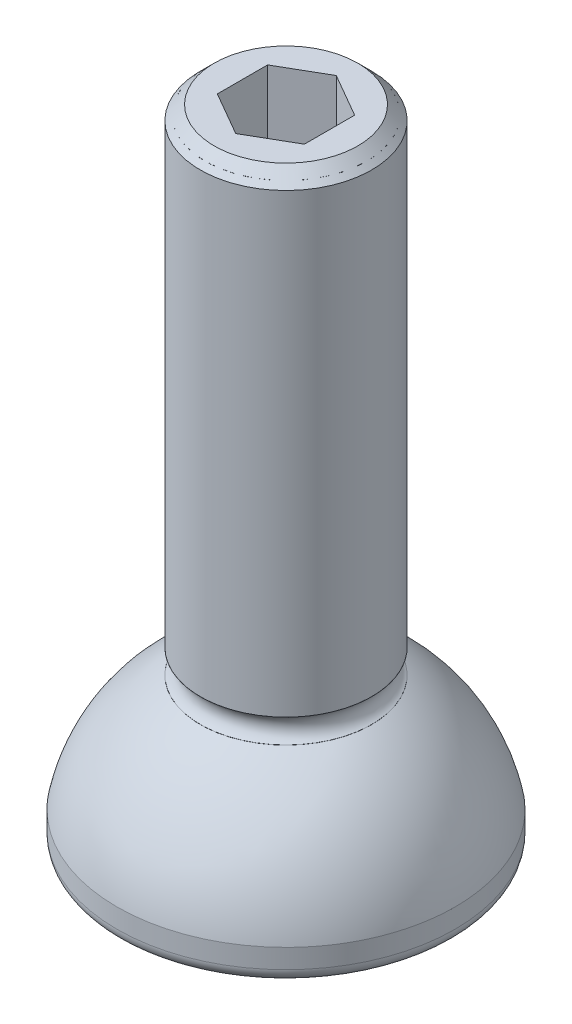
ISO-10303-21;
HEADER;
FILE_DESCRIPTION(('STEP AP214'),'2;1');
FILE_NAME('part.step','',(''),(''),'','','');
FILE_SCHEMA(('AUTOMOTIVE_DESIGN { 1 0 10303 214 1 1 1 1 }'));
ENDSEC;
DATA;
#1=APPLICATION_CONTEXT('core data for automotive mechanical design processes');
#2=APPLICATION_PROTOCOL_DEFINITION('international standard','automotive_design',2000,#1);
#3=PRODUCT_CONTEXT('',#1,'mechanical');
#4=PRODUCT('Part','Part','',(#3));
#5=PRODUCT_RELATED_PRODUCT_CATEGORY('part','',(#4));
#6=PRODUCT_DEFINITION_FORMATION('','',#4);
#7=PRODUCT_DEFINITION_CONTEXT('part definition',#1,'design');
#8=PRODUCT_DEFINITION('design','',#6,#7);
#9=PRODUCT_DEFINITION_SHAPE('','',#8);
#10=(LENGTH_UNIT() NAMED_UNIT(*) SI_UNIT(.MILLI.,.METRE.));
#11=(NAMED_UNIT(*) PLANE_ANGLE_UNIT() SI_UNIT($,.RADIAN.));
#12=(NAMED_UNIT(*) SI_UNIT($,.STERADIAN.) SOLID_ANGLE_UNIT());
#13=UNCERTAINTY_MEASURE_WITH_UNIT(LENGTH_MEASURE(1.E-05),#10,'distance_accuracy_value','');
#14=(GEOMETRIC_REPRESENTATION_CONTEXT(3) GLOBAL_UNCERTAINTY_ASSIGNED_CONTEXT((#13)) GLOBAL_UNIT_ASSIGNED_CONTEXT((#10,
#11,#12)) REPRESENTATION_CONTEXT('',''));
#15=CARTESIAN_POINT('',(0.,0.,0.));
#16=DIRECTION('',(0.,0.,1.));
#17=DIRECTION('',(1.,0.,0.));
#18=AXIS2_PLACEMENT_3D('',#15,#16,#17);
#19=CARTESIAN_POINT('',(0.,38.8366000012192,0.));
#20=DIRECTION('',(0.,-1.,0.));
#21=DIRECTION('',(0.,0.,-1.));
#22=AXIS2_PLACEMENT_3D('',#19,#20,#21);
#23=CYLINDRICAL_SURFACE('',#22,4.4196);
#24=CARTESIAN_POINT('',(0.,9.5245113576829,0.));
#25=DIRECTION('',(0.,-1.,0.));
#26=DIRECTION('',(0.,0.,-1.));
#27=AXIS2_PLACEMENT_3D('',#24,#25,#26);
#28=CIRCLE('',#27,4.4196);
#29=CARTESIAN_POINT('',(0.,9.5245113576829,-4.4196));
#30=VERTEX_POINT('',#29);
#31=EDGE_CURVE('P0_E21',#30,#30,#28,.F.);
#32=ORIENTED_EDGE('',*,*,#31,.T.);
#33=EDGE_LOOP('',(#32));
#34=FACE_BOUND('',#33,.T.);
#35=CARTESIAN_POINT('',(0.,34.8234,0.));
#36=DIRECTION('',(0.,-1.,0.));
#37=DIRECTION('',(0.,0.,-1.));
#38=AXIS2_PLACEMENT_3D('',#35,#36,#37);
#39=CIRCLE('',#38,4.4196);
#40=CARTESIAN_POINT('',(0.,34.8234,-4.4196));
#41=VERTEX_POINT('',#40);
#42=EDGE_CURVE('P0_E11',#41,#41,#39,.T.);
#43=ORIENTED_EDGE('',*,*,#42,.T.);
#44=EDGE_LOOP('',(#43));
#45=FACE_BOUND('',#44,.T.);
#46=ADVANCED_FACE('P0_F17',(#34,#45),#23,.T.);
#47=CARTESIAN_POINT('',(0.,9.5245113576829,0.));
#48=DIRECTION('',(0.,-1.,0.));
#49=DIRECTION('',(0.,0.,-1.));
#50=AXIS2_PLACEMENT_3D('',#47,#48,#49);
#51=PLANE('',#50);
#52=ORIENTED_EDGE('',*,*,#31,.F.);
#53=EDGE_LOOP('',(#52));
#54=FACE_BOUND('',#53,.T.);
#55=CARTESIAN_POINT('',(4.699,9.5245113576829,0.));
#56=CARTESIAN_POINT('',(4.69879762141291,9.5245113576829,0.896547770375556));
#57=CARTESIAN_POINT('',(4.36907522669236,9.5245113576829,1.72967704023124));
#58=CARTESIAN_POINT('',(4.19396376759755,9.5245113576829,2.17214162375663));
#59=CARTESIAN_POINT('',(3.93304190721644,9.5245113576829,2.57133863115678));
#60=CARTESIAN_POINT('',(3.66711031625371,9.5245113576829,2.97820026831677));
#61=CARTESIAN_POINT('',(3.32269476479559,9.5245113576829,3.32269476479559));
#62=CARTESIAN_POINT('',(2.97903656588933,9.5245113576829,3.6664317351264));
#63=CARTESIAN_POINT('',(2.57133863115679,9.5245113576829,3.93304190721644));
#64=CARTESIAN_POINT('',(2.17307868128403,9.5245113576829,4.19348019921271));
#65=CARTESIAN_POINT('',(1.72967704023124,9.5245113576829,4.36907522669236));
#66=CARTESIAN_POINT('',(0.89682712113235,9.5245113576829,4.69889877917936));
#67=CARTESIAN_POINT('',(0.,9.5245113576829,4.699));
#68=CARTESIAN_POINT('',(-0.895780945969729,9.5245113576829,4.69910110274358));
#69=CARTESIAN_POINT('',(-1.72967704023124,9.5245113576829,4.36907522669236));
#70=CARTESIAN_POINT('',(-2.1721416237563,9.5245113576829,4.19396376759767));
#71=CARTESIAN_POINT('',(-2.57133863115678,9.5245113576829,3.93304190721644));
#72=CARTESIAN_POINT('',(-2.97820026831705,9.5245113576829,3.66711031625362));
#73=CARTESIAN_POINT('',(-3.32269476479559,9.5245113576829,3.32269476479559));
#74=CARTESIAN_POINT('',(-3.66643173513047,9.5245113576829,2.97903656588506));
#75=CARTESIAN_POINT('',(-3.93304190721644,9.5245113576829,2.57133863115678));
#76=CARTESIAN_POINT('',(-4.19348019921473,9.5245113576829,2.17307868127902));
#77=CARTESIAN_POINT('',(-4.36907522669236,9.5245113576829,1.72967704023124));
#78=CARTESIAN_POINT('',(-4.69879750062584,9.5245113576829,0.897082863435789));
#79=CARTESIAN_POINT('',(-4.699,9.5245113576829,0.));
#80=B_SPLINE_CURVE_WITH_KNOTS('',2,(#55,#56,#57,#58,#59,#60,#61,#62,#63,#64,#65,#66,#67,#68,#69,
#70,#71,#72,#73,#74,#75,#76,#77,#78,#79),.UNSPECIFIED.,.F.,.F.,(3,2,2,2,2,2,2,2,2,2,2,2,3),(0.,
0.125,0.1875,0.25,0.3125,0.375,0.5,0.625,0.6875,0.75,0.8125,0.875,1.),.UNSPECIFIED.);
#81=CARTESIAN_POINT('',(4.699,9.5245113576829,0.));
#82=VERTEX_POINT('',#81);
#83=CARTESIAN_POINT('',(-4.699,9.5245113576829,0.));
#84=VERTEX_POINT('',#83);
#85=EDGE_CURVE('P0_E29',#82,#84,#80,.T.);
#86=ORIENTED_EDGE('',*,*,#85,.F.);
#87=CARTESIAN_POINT('',(-4.699,9.5245113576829,0.));
#88=CARTESIAN_POINT('',(-4.69879762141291,9.5245113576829,-0.896547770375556));
#89=CARTESIAN_POINT('',(-4.36907522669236,9.5245113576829,-1.72967704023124));
#90=CARTESIAN_POINT('',(-4.19396376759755,9.5245113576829,-2.17214162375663));
#91=CARTESIAN_POINT('',(-3.93304190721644,9.5245113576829,-2.57133863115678));
#92=CARTESIAN_POINT('',(-3.66711031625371,9.5245113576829,-2.97820026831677));
#93=CARTESIAN_POINT('',(-3.32269476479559,9.5245113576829,-3.32269476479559));
#94=CARTESIAN_POINT('',(-2.97903656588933,9.5245113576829,-3.6664317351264));
#95=CARTESIAN_POINT('',(-2.57133863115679,9.5245113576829,-3.93304190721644));
#96=CARTESIAN_POINT('',(-2.17307868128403,9.5245113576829,-4.19348019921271));
#97=CARTESIAN_POINT('',(-1.72967704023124,9.5245113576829,-4.36907522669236));
#98=CARTESIAN_POINT('',(-0.89682712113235,9.5245113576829,-4.69889877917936));
#99=CARTESIAN_POINT('',(0.,9.5245113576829,-4.699));
#100=CARTESIAN_POINT('',(0.895780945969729,9.5245113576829,-4.69910110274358));
#101=CARTESIAN_POINT('',(1.72967704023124,9.5245113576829,-4.36907522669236));
#102=CARTESIAN_POINT('',(2.1721416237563,9.5245113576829,-4.19396376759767));
#103=CARTESIAN_POINT('',(2.57133863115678,9.5245113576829,-3.93304190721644));
#104=CARTESIAN_POINT('',(2.97820026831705,9.5245113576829,-3.66711031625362));
#105=CARTESIAN_POINT('',(3.32269476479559,9.5245113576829,-3.32269476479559));
#106=CARTESIAN_POINT('',(3.66643173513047,9.5245113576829,-2.97903656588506));
#107=CARTESIAN_POINT('',(3.93304190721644,9.5245113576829,-2.57133863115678));
#108=CARTESIAN_POINT('',(4.19348019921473,9.5245113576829,-2.17307868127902));
#109=CARTESIAN_POINT('',(4.36907522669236,9.5245113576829,-1.72967704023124));
#110=CARTESIAN_POINT('',(4.69879750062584,9.5245113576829,-0.897082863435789));
#111=CARTESIAN_POINT('',(4.699,9.5245113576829,0.));
#112=B_SPLINE_CURVE_WITH_KNOTS('',2,(#87,#88,#89,#90,#91,#92,#93,#94,#95,#96,#97,#98,#99,#100,
#101,#102,#103,#104,#105,#106,#107,#108,#109,#110,#111),.UNSPECIFIED.,.F.,.F.,(3,2,2,2,2,2,2,2,
2,2,2,2,3),(0.,0.125,0.1875,0.25,0.3125,0.375,0.5,0.625,0.6875,0.75,0.8125,0.875,1.),.UNSPECIFIED.);
#113=EDGE_CURVE('P0_E33',#84,#82,#112,.T.);
#114=ORIENTED_EDGE('',*,*,#113,.F.);
#115=EDGE_LOOP('',(#86,#114));
#116=FACE_BOUND('',#115,.T.);
#117=ADVANCED_FACE('P0_F18',(#54,#116),#51,.F.);
#118=OPEN_SHELL('',(#46,#117));
#119=SHELL_BASED_SURFACE_MODEL('P0_B1',(#118));
#120=CARTESIAN_POINT('',(0.,30.48,0.));
#121=DIRECTION('',(0.,1.,0.));
#122=DIRECTION('',(0.,0.,1.));
#123=AXIS2_PLACEMENT_3D('',#120,#121,#122);
#124=PLANE('',#123);
#125=DIRECTION('',(-0.866025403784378,0.,-0.500000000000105));
#126=VECTOR('',#125,1.);
#127=CARTESIAN_POINT('',(2.3876,30.48,-1.37848150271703));
#128=LINE('',#127,#126);
#129=CARTESIAN_POINT('',(2.3876,30.48,-1.37848150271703));
#130=VERTEX_POINT('',#129);
#131=CARTESIAN_POINT('',(1.19379999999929,30.48,-2.0677222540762));
#132=VERTEX_POINT('',#131);
#133=EDGE_CURVE('P1_E110',#130,#132,#128,.T.);
#134=ORIENTED_EDGE('',*,*,#133,.T.);
#135=CARTESIAN_POINT('',(0.,30.48,0.));
#136=DIRECTION('',(0.,1.,0.));
#137=DIRECTION('',(0.,0.,1.));
#138=AXIS2_PLACEMENT_3D('',#135,#136,#137);
#139=CIRCLE('',#138,2.3876);
#140=CARTESIAN_POINT('',(2.3876,30.48,0.));
#141=VERTEX_POINT('',#140);
#142=EDGE_CURVE('P1_E113',#132,#141,#139,.F.);
#143=ORIENTED_EDGE('',*,*,#142,.T.);
#144=DIRECTION('',(0.,0.,1.));
#145=VECTOR('',#144,1.);
#146=CARTESIAN_POINT('',(2.3876,30.48,0.));
#147=LINE('',#146,#145);
#148=EDGE_CURVE('P1_E101',#141,#130,#147,.F.);
#149=ORIENTED_EDGE('',*,*,#148,.T.);
#150=EDGE_LOOP('',(#134,#143,#149));
#151=FACE_BOUND('',#150,.T.);
#152=ADVANCED_FACE('P1_F17',(#151),#124,.T.);
#153=CARTESIAN_POINT('',(0.,30.48,0.));
#154=DIRECTION('',(0.,1.,0.));
#155=DIRECTION('',(0.,0.,1.));
#156=AXIS2_PLACEMENT_3D('',#153,#154,#155);
#157=PLANE('',#156);
#158=DIRECTION('',(0.,0.,1.));
#159=VECTOR('',#158,1.);
#160=CARTESIAN_POINT('',(-2.3876,30.48,0.));
#161=LINE('',#160,#159);
#162=CARTESIAN_POINT('',(-2.38759999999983,30.48,-1.37848150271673));
#163=VERTEX_POINT('',#162);
#164=CARTESIAN_POINT('',(-2.3876,30.48,0.));
#165=VERTEX_POINT('',#164);
#166=EDGE_CURVE('P1_E164',#163,#165,#161,.T.);
#167=ORIENTED_EDGE('',*,*,#166,.T.);
#168=CARTESIAN_POINT('',(0.,30.48,0.));
#169=DIRECTION('',(0.,1.,0.));
#170=DIRECTION('',(0.,0.,1.));
#171=AXIS2_PLACEMENT_3D('',#168,#169,#170);
#172=CIRCLE('',#171,2.3876);
#173=CARTESIAN_POINT('',(-1.19379999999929,30.48,-2.0677222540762));
#174=VERTEX_POINT('',#173);
#175=EDGE_CURVE('P1_E118',#165,#174,#172,.F.);
#176=ORIENTED_EDGE('',*,*,#175,.T.);
#177=DIRECTION('',(-0.866025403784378,0.,0.500000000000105));
#178=VECTOR('',#177,1.);
#179=CARTESIAN_POINT('',(-1.1938,30.48,-2.0677222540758));
#180=LINE('',#179,#178);
#181=EDGE_CURVE('P1_E169',#174,#163,#180,.T.);
#182=ORIENTED_EDGE('',*,*,#181,.T.);
#183=EDGE_LOOP('',(#167,#176,#182));
#184=FACE_BOUND('',#183,.T.);
#185=ADVANCED_FACE('P1_F256',(#184),#157,.T.);
#186=CARTESIAN_POINT('',(0.,30.48,0.));
#187=DIRECTION('',(0.,1.,0.));
#188=DIRECTION('',(0.,0.,1.));
#189=AXIS2_PLACEMENT_3D('',#186,#187,#188);
#190=PLANE('',#189);
#191=DIRECTION('',(-0.866025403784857,0.,0.499999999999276));
#192=VECTOR('',#191,1.);
#193=CARTESIAN_POINT('',(0.,30.48,-2.75696300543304));
#194=LINE('',#193,#192);
#195=CARTESIAN_POINT('',(0.,30.48,-2.75696300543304));
#196=VERTEX_POINT('',#195);
#197=EDGE_CURVE('P1_E119',#196,#174,#194,.T.);
#198=ORIENTED_EDGE('',*,*,#197,.T.);
#199=CARTESIAN_POINT('',(0.,30.48,0.));
#200=DIRECTION('',(0.,1.,0.));
#201=DIRECTION('',(0.,0.,1.));
#202=AXIS2_PLACEMENT_3D('',#199,#200,#201);
#203=CIRCLE('',#202,2.3876);
#204=EDGE_CURVE('P1_E140',#174,#132,#203,.F.);
#205=ORIENTED_EDGE('',*,*,#204,.T.);
#206=DIRECTION('',(-0.866025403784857,0.,-0.499999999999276));
#207=VECTOR('',#206,1.);
#208=CARTESIAN_POINT('',(1.1938,30.48,-2.0677222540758));
#209=LINE('',#208,#207);
#210=EDGE_CURVE('P1_E95',#132,#196,#209,.T.);
#211=ORIENTED_EDGE('',*,*,#210,.T.);
#212=EDGE_LOOP('',(#198,#205,#211));
#213=FACE_BOUND('',#212,.T.);
#214=ADVANCED_FACE('P1_F253',(#213),#190,.T.);
#215=CARTESIAN_POINT('',(0.,28.9559999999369,0.));
#216=DIRECTION('',(0.,1.,0.));
#217=DIRECTION('',(0.,0.,1.));
#218=AXIS2_PLACEMENT_3D('',#215,#216,#217);
#219=CONICAL_SURFACE('',#218,2.38759999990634,1.02974425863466);
#220=CARTESIAN_POINT('',(0.,28.956,0.));
#221=DIRECTION('',(0.,1.,0.));
#222=DIRECTION('',(0.,0.,1.));
#223=AXIS2_PLACEMENT_3D('',#220,#221,#222);
#224=CIRCLE('',#223,2.3876);
#225=CARTESIAN_POINT('',(0.,28.956,2.3876));
#226=VERTEX_POINT('',#225);
#227=EDGE_CURVE('P1_E131',#226,#226,#224,.T.);
#228=ORIENTED_EDGE('',*,*,#227,.T.);
#229=EDGE_LOOP('',(#228));
#230=FACE_BOUND('',#229,.T.);
#231=CARTESIAN_POINT('',(1.4210854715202E-10,27.5213851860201,0.));
#232=VERTEX_POINT('',#231);
#233=VERTEX_LOOP('',#232);
#234=FACE_BOUND('',#233,.T.);
#235=ADVANCED_FACE('P1_F250',(#230,#234),#219,.F.);
#236=CARTESIAN_POINT('',(0.,30.48,0.));
#237=DIRECTION('',(0.,1.,0.));
#238=DIRECTION('',(0.,0.,1.));
#239=AXIS2_PLACEMENT_3D('',#236,#237,#238);
#240=PLANE('',#239);
#241=DIRECTION('',(0.,0.,1.));
#242=VECTOR('',#241,1.);
#243=CARTESIAN_POINT('',(2.3876,30.48,0.));
#244=LINE('',#243,#242);
#245=CARTESIAN_POINT('',(2.3876,30.48,1.37848150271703));
#246=VERTEX_POINT('',#245);
#247=EDGE_CURVE('P1_E106',#246,#141,#244,.F.);
#248=ORIENTED_EDGE('',*,*,#247,.T.);
#249=CARTESIAN_POINT('',(0.,30.48,0.));
#250=DIRECTION('',(0.,1.,0.));
#251=DIRECTION('',(0.,0.,1.));
#252=AXIS2_PLACEMENT_3D('',#249,#250,#251);
#253=CIRCLE('',#252,2.3876);
#254=CARTESIAN_POINT('',(1.19379999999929,30.48,2.0677222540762));
#255=VERTEX_POINT('',#254);
#256=EDGE_CURVE('P1_E123',#141,#255,#253,.F.);
#257=ORIENTED_EDGE('',*,*,#256,.T.);
#258=DIRECTION('',(0.866025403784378,0.,-0.500000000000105));
#259=VECTOR('',#258,1.);
#260=CARTESIAN_POINT('',(1.1938,30.48,2.0677222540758));
#261=LINE('',#260,#259);
#262=EDGE_CURVE('P1_E134',#255,#246,#261,.T.);
#263=ORIENTED_EDGE('',*,*,#262,.T.);
#264=EDGE_LOOP('',(#248,#257,#263));
#265=FACE_BOUND('',#264,.T.);
#266=ADVANCED_FACE('P1_F133',(#265),#240,.T.);
#267=CARTESIAN_POINT('',(0.,30.48,0.));
#268=DIRECTION('',(0.,1.,0.));
#269=DIRECTION('',(0.,0.,1.));
#270=AXIS2_PLACEMENT_3D('',#267,#268,#269);
#271=PLANE('',#270);
#272=DIRECTION('',(0.866025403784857,0.,-0.499999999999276));
#273=VECTOR('',#272,1.);
#274=CARTESIAN_POINT('',(0.,30.48,2.75696300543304));
#275=LINE('',#274,#273);
#276=CARTESIAN_POINT('',(0.,30.48,2.75696300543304));
#277=VERTEX_POINT('',#276);
#278=EDGE_CURVE('P1_E138',#277,#255,#275,.T.);
#279=ORIENTED_EDGE('',*,*,#278,.T.);
#280=CARTESIAN_POINT('',(0.,30.48,0.));
#281=DIRECTION('',(0.,1.,0.));
#282=DIRECTION('',(0.,0.,1.));
#283=AXIS2_PLACEMENT_3D('',#280,#281,#282);
#284=CIRCLE('',#283,2.3876);
#285=CARTESIAN_POINT('',(-1.19379999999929,30.48,2.0677222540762));
#286=VERTEX_POINT('',#285);
#287=EDGE_CURVE('P1_E127',#255,#286,#284,.F.);
#288=ORIENTED_EDGE('',*,*,#287,.T.);
#289=DIRECTION('',(0.866025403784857,0.,0.499999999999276));
#290=VECTOR('',#289,1.);
#291=CARTESIAN_POINT('',(-1.1938,30.48,2.0677222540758));
#292=LINE('',#291,#290);
#293=EDGE_CURVE('P1_E135',#286,#277,#292,.T.);
#294=ORIENTED_EDGE('',*,*,#293,.T.);
#295=EDGE_LOOP('',(#279,#288,#294));
#296=FACE_BOUND('',#295,.T.);
#297=ADVANCED_FACE('P1_F243',(#296),#271,.T.);
#298=CARTESIAN_POINT('',(0.,0.,0.));
#299=DIRECTION('',(0.,-1.,0.));
#300=DIRECTION('',(0.,0.,-1.));
#301=AXIS2_PLACEMENT_3D('',#298,#299,#300);
#302=PLANE('',#301);
#303=CARTESIAN_POINT('',(0.,0.,0.));
#304=DIRECTION('',(0.,1.,0.));
#305=DIRECTION('',(-1.,0.,0.));
#306=AXIS2_PLACEMENT_3D('',#303,#304,#305);
#307=CIRCLE('',#306,8.509);
#308=CARTESIAN_POINT('',(-8.509,0.,0.));
#309=VERTEX_POINT('',#308);
#310=CARTESIAN_POINT('',(8.509,0.,0.));
#311=VERTEX_POINT('',#310);
#312=EDGE_CURVE('P1_E178',#309,#311,#307,.T.);
#313=ORIENTED_EDGE('',*,*,#312,.F.);
#314=CARTESIAN_POINT('',(0.,0.,0.));
#315=DIRECTION('',(0.,1.,0.));
#316=DIRECTION('',(1.,0.,0.));
#317=AXIS2_PLACEMENT_3D('',#314,#315,#316);
#318=CIRCLE('',#317,8.509);
#319=EDGE_CURVE('P1_E212',#311,#309,#318,.T.);
#320=ORIENTED_EDGE('',*,*,#319,.F.);
#321=EDGE_LOOP('',(#313,#320));
#322=FACE_BOUND('',#321,.T.);
#323=ADVANCED_FACE('P1_F225',(#322),#302,.T.);
#324=CARTESIAN_POINT('',(0.,27.1321544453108,0.));
#325=DIRECTION('',(0.,1.,0.));
#326=DIRECTION('',(0.,0.,1.));
#327=AXIS2_PLACEMENT_3D('',#324,#325,#326);
#328=CYLINDRICAL_SURFACE('',#327,2.3876);
#329=ORIENTED_EDGE('',*,*,#227,.F.);
#330=EDGE_LOOP('',(#329));
#331=FACE_BOUND('',#330,.T.);
#332=ORIENTED_EDGE('',*,*,#256,.F.);
#333=ORIENTED_EDGE('',*,*,#142,.F.);
#334=ORIENTED_EDGE('',*,*,#204,.F.);
#335=ORIENTED_EDGE('',*,*,#175,.F.);
#336=CARTESIAN_POINT('',(0.,30.48,0.));
#337=DIRECTION('',(0.,1.,0.));
#338=DIRECTION('',(0.,0.,1.));
#339=AXIS2_PLACEMENT_3D('',#336,#337,#338);
#340=CIRCLE('',#339,2.3876);
#341=EDGE_CURVE('P1_E207',#286,#165,#340,.F.);
#342=ORIENTED_EDGE('',*,*,#341,.F.);
#343=ORIENTED_EDGE('',*,*,#287,.F.);
#344=EDGE_LOOP('',(#332,#333,#334,#335,#342,#343));
#345=FACE_BOUND('',#344,.T.);
#346=ADVANCED_FACE('P1_F124',(#331,#345),#328,.F.);
#347=CARTESIAN_POINT('',(0.,0.762,0.));
#348=DIRECTION('',(0.,-1.,0.));
#349=DIRECTION('',(0.999967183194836,0.,0.00810139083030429));
#350=AXIS2_PLACEMENT_3D('',#347,#348,#349);
#351=TOROIDAL_SURFACE('',#350,8.509,0.762);
#352=ORIENTED_EDGE('',*,*,#312,.T.);
#353=ORIENTED_EDGE('',*,*,#319,.T.);
#354=EDGE_LOOP('',(#352,#353));
#355=FACE_BOUND('',#354,.T.);
#356=CARTESIAN_POINT('',(0.,0.762,0.));
#357=DIRECTION('',(0.,-1.,0.));
#358=DIRECTION('',(0.,0.,-1.));
#359=AXIS2_PLACEMENT_3D('',#356,#357,#358);
#360=CIRCLE('',#359,9.271);
#361=CARTESIAN_POINT('',(0.,0.762,-9.271));
#362=VERTEX_POINT('',#361);
#363=EDGE_CURVE('P1_E210',#362,#362,#360,.F.);
#364=ORIENTED_EDGE('',*,*,#363,.F.);
#365=EDGE_LOOP('',(#364));
#366=FACE_BOUND('',#365,.T.);
#367=ADVANCED_FACE('P1_F219',(#355,#366),#351,.T.);
#368=CARTESIAN_POINT('',(0.,30.48,0.));
#369=DIRECTION('',(0.,1.,0.));
#370=DIRECTION('',(0.,0.,1.));
#371=AXIS2_PLACEMENT_3D('',#368,#369,#370);
#372=PLANE('',#371);
#373=DIRECTION('',(0.866025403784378,0.,0.500000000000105));
#374=VECTOR('',#373,1.);
#375=CARTESIAN_POINT('',(-2.3876,30.48,1.37848150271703));
#376=LINE('',#375,#374);
#377=CARTESIAN_POINT('',(-2.3876,30.48,1.37848150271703));
#378=VERTEX_POINT('',#377);
#379=EDGE_CURVE('P1_E211',#378,#286,#376,.T.);
#380=ORIENTED_EDGE('',*,*,#379,.T.);
#381=ORIENTED_EDGE('',*,*,#341,.T.);
#382=DIRECTION('',(0.,0.,1.));
#383=VECTOR('',#382,1.);
#384=CARTESIAN_POINT('',(-2.3876,30.48,-1.37848150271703));
#385=LINE('',#384,#383);
#386=EDGE_CURVE('P1_E341',#165,#378,#385,.T.);
#387=ORIENTED_EDGE('',*,*,#386,.T.);
#388=EDGE_LOOP('',(#380,#381,#387));
#389=FACE_BOUND('',#388,.T.);
#390=ADVANCED_FACE('P1_F327',(#389),#372,.T.);
#391=CARTESIAN_POINT('',(0.,0.,0.));
#392=DIRECTION('',(0.,-1.,0.));
#393=DIRECTION('',(0.,0.,-1.));
#394=AXIS2_PLACEMENT_3D('',#391,#392,#393);
#395=CYLINDRICAL_SURFACE('',#394,9.271);
#396=CARTESIAN_POINT('',(0.,1.82438494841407,0.));
#397=DIRECTION('',(0.,-1.,0.));
#398=DIRECTION('',(0.,0.,-1.));
#399=AXIS2_PLACEMENT_3D('',#396,#397,#398);
#400=CIRCLE('',#399,9.271);
#401=CARTESIAN_POINT('',(0.,1.82438494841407,-9.271));
#402=VERTEX_POINT('',#401);
#403=EDGE_CURVE('P1_E190',#402,#402,#400,.F.);
#404=ORIENTED_EDGE('',*,*,#403,.F.);
#405=EDGE_LOOP('',(#404));
#406=FACE_BOUND('',#405,.T.);
#407=ORIENTED_EDGE('',*,*,#363,.T.);
#408=EDGE_LOOP('',(#407));
#409=FACE_BOUND('',#408,.T.);
#410=ADVANCED_FACE('P1_F323',(#406,#409),#395,.T.);
#411=CARTESIAN_POINT('',(-2.3876,35.306,-1.37848150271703));
#412=DIRECTION('',(-1.,0.,0.));
#413=DIRECTION('',(0.,0.,1.));
#414=AXIS2_PLACEMENT_3D('',#411,#412,#413);
#415=PLANE('',#414);
#416=ORIENTED_EDGE('',*,*,#386,.F.);
#417=ORIENTED_EDGE('',*,*,#166,.F.);
#418=DIRECTION('',(0.,1.,0.));
#419=VECTOR('',#418,1.);
#420=CARTESIAN_POINT('',(-2.38759999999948,35.306,-1.37848150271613));
#421=LINE('',#420,#419);
#422=CARTESIAN_POINT('',(-2.38759999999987,35.306,-1.3784815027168));
#423=VERTEX_POINT('',#422);
#424=EDGE_CURVE('P1_E186',#163,#423,#421,.T.);
#425=ORIENTED_EDGE('',*,*,#424,.T.);
#426=DIRECTION('',(0.,0.,-1.));
#427=VECTOR('',#426,1.);
#428=CARTESIAN_POINT('',(-2.3876,35.306,0.));
#429=LINE('',#428,#427);
#430=CARTESIAN_POINT('',(-2.3876,35.306,1.37848150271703));
#431=VERTEX_POINT('',#430);
#432=EDGE_CURVE('P1_E206',#423,#431,#429,.F.);
#433=ORIENTED_EDGE('',*,*,#432,.T.);
#434=DIRECTION('',(0.,1.,0.));
#435=VECTOR('',#434,1.);
#436=CARTESIAN_POINT('',(-2.3876,35.306,1.37848150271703));
#437=LINE('',#436,#435);
#438=EDGE_CURVE('P1_E153',#431,#378,#437,.F.);
#439=ORIENTED_EDGE('',*,*,#438,.T.);
#440=EDGE_LOOP('',(#416,#417,#425,#433,#439));
#441=FACE_BOUND('',#440,.T.);
#442=ADVANCED_FACE('P1_F319',(#441),#415,.F.);
#443=CARTESIAN_POINT('',(-2.3876,35.306,1.37848150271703));
#444=DIRECTION('',(-0.500000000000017,0.,0.866025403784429));
#445=DIRECTION('',(0.866025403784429,0.,0.500000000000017));
#446=AXIS2_PLACEMENT_3D('',#443,#444,#445);
#447=PLANE('',#446);
#448=ORIENTED_EDGE('',*,*,#293,.F.);
#449=ORIENTED_EDGE('',*,*,#379,.F.);
#450=ORIENTED_EDGE('',*,*,#438,.F.);
#451=DIRECTION('',(0.866025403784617,0.,0.49999999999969));
#452=VECTOR('',#451,1.);
#453=CARTESIAN_POINT('',(-2.3876,35.306,1.37848150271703));
#454=LINE('',#453,#452);
#455=CARTESIAN_POINT('',(-2.59544447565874E-13,35.306,2.75696300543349));
#456=VERTEX_POINT('',#455);
#457=EDGE_CURVE('P1_E289',#431,#456,#454,.T.);
#458=ORIENTED_EDGE('',*,*,#457,.T.);
#459=DIRECTION('',(0.,1.,0.));
#460=VECTOR('',#459,1.);
#461=CARTESIAN_POINT('',(0.,35.306,2.75696300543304));
#462=LINE('',#461,#460);
#463=EDGE_CURVE('P1_E149',#456,#277,#462,.F.);
#464=ORIENTED_EDGE('',*,*,#463,.T.);
#465=EDGE_LOOP('',(#448,#449,#450,#458,#464));
#466=FACE_BOUND('',#465,.T.);
#467=ADVANCED_FACE('P1_F315',(#466),#447,.F.);
#468=CARTESIAN_POINT('',(0.,35.306,2.75696300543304));
#469=DIRECTION('',(0.500000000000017,0.,0.866025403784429));
#470=DIRECTION('',(0.866025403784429,0.,-0.500000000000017));
#471=AXIS2_PLACEMENT_3D('',#468,#469,#470);
#472=PLANE('',#471);
#473=ORIENTED_EDGE('',*,*,#262,.F.);
#474=ORIENTED_EDGE('',*,*,#278,.F.);
#475=ORIENTED_EDGE('',*,*,#463,.F.);
#476=DIRECTION('',(0.866025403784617,0.,-0.49999999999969));
#477=VECTOR('',#476,1.);
#478=CARTESIAN_POINT('',(0.,35.306,2.75696300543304));
#479=LINE('',#478,#477);
#480=CARTESIAN_POINT('',(2.38759999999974,35.306,1.37848150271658));
#481=VERTEX_POINT('',#480);
#482=EDGE_CURVE('P1_E287',#456,#481,#479,.T.);
#483=ORIENTED_EDGE('',*,*,#482,.T.);
#484=DIRECTION('',(0.,1.,0.));
#485=VECTOR('',#484,1.);
#486=CARTESIAN_POINT('',(2.3876,35.306,1.37848150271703));
#487=LINE('',#486,#485);
#488=EDGE_CURVE('P1_E152',#481,#246,#487,.F.);
#489=ORIENTED_EDGE('',*,*,#488,.T.);
#490=EDGE_LOOP('',(#473,#474,#475,#483,#489));
#491=FACE_BOUND('',#490,.T.);
#492=ADVANCED_FACE('P1_F312',(#491),#472,.F.);
#493=CARTESIAN_POINT('',(2.3876,35.306,1.37848150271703));
#494=DIRECTION('',(1.,0.,0.));
#495=DIRECTION('',(0.,0.,-1.));
#496=AXIS2_PLACEMENT_3D('',#493,#494,#495);
#497=PLANE('',#496);
#498=ORIENTED_EDGE('',*,*,#148,.F.);
#499=ORIENTED_EDGE('',*,*,#247,.F.);
#500=ORIENTED_EDGE('',*,*,#488,.F.);
#501=DIRECTION('',(0.,0.,-1.));
#502=VECTOR('',#501,1.);
#503=CARTESIAN_POINT('',(2.3876,35.306,0.));
#504=LINE('',#503,#502);
#505=CARTESIAN_POINT('',(2.3876,35.306,-1.37848150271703));
#506=VERTEX_POINT('',#505);
#507=EDGE_CURVE('P1_E285',#481,#506,#504,.T.);
#508=ORIENTED_EDGE('',*,*,#507,.T.);
#509=DIRECTION('',(0.,1.,0.));
#510=VECTOR('',#509,1.);
#511=CARTESIAN_POINT('',(2.3876,35.306,-1.37848150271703));
#512=LINE('',#511,#510);
#513=EDGE_CURVE('P1_E108',#506,#130,#512,.F.);
#514=ORIENTED_EDGE('',*,*,#513,.T.);
#515=EDGE_LOOP('',(#498,#499,#500,#508,#514));
#516=FACE_BOUND('',#515,.T.);
#517=ADVANCED_FACE('P1_F103',(#516),#497,.F.);
#518=CARTESIAN_POINT('',(2.3876,35.306,-1.37848150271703));
#519=DIRECTION('',(0.500000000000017,0.,-0.866025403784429));
#520=DIRECTION('',(-0.866025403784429,0.,-0.500000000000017));
#521=AXIS2_PLACEMENT_3D('',#518,#519,#520);
#522=PLANE('',#521);
#523=ORIENTED_EDGE('',*,*,#210,.F.);
#524=ORIENTED_EDGE('',*,*,#133,.F.);
#525=ORIENTED_EDGE('',*,*,#513,.F.);
#526=DIRECTION('',(-0.866025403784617,0.,-0.49999999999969));
#527=VECTOR('',#526,1.);
#528=CARTESIAN_POINT('',(2.3876,35.306,-1.37848150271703));
#529=LINE('',#528,#527);
#530=CARTESIAN_POINT('',(2.59544447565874E-13,35.306,-2.75696300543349));
#531=VERTEX_POINT('',#530);
#532=EDGE_CURVE('P1_E37',#506,#531,#529,.T.);
#533=ORIENTED_EDGE('',*,*,#532,.T.);
#534=DIRECTION('',(0.,1.,0.));
#535=VECTOR('',#534,1.);
#536=CARTESIAN_POINT('',(0.,35.306,-2.75696300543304));
#537=LINE('',#536,#535);
#538=EDGE_CURVE('P1_E184',#531,#196,#537,.F.);
#539=ORIENTED_EDGE('',*,*,#538,.T.);
#540=EDGE_LOOP('',(#523,#524,#525,#533,#539));
#541=FACE_BOUND('',#540,.T.);
#542=ADVANCED_FACE('P1_F306',(#541),#522,.F.);
#543=CARTESIAN_POINT('',(0.,35.306,-2.75696300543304));
#544=DIRECTION('',(-0.500000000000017,0.,-0.866025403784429));
#545=DIRECTION('',(-0.866025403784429,0.,0.500000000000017));
#546=AXIS2_PLACEMENT_3D('',#543,#544,#545);
#547=PLANE('',#546);
#548=ORIENTED_EDGE('',*,*,#181,.F.);
#549=ORIENTED_EDGE('',*,*,#197,.F.);
#550=ORIENTED_EDGE('',*,*,#538,.F.);
#551=DIRECTION('',(-0.866025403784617,0.,0.49999999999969));
#552=VECTOR('',#551,1.);
#553=CARTESIAN_POINT('',(0.,35.306,-2.75696300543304));
#554=LINE('',#553,#552);
#555=EDGE_CURVE('P1_E203',#531,#423,#554,.T.);
#556=ORIENTED_EDGE('',*,*,#555,.T.);
#557=ORIENTED_EDGE('',*,*,#424,.F.);
#558=EDGE_LOOP('',(#548,#549,#550,#556,#557));
#559=FACE_BOUND('',#558,.T.);
#560=ADVANCED_FACE('P1_F302',(#559),#547,.F.);
#561=CARTESIAN_POINT('',(0.,0.,0.));
#562=DIRECTION('',(-1.,0.,0.));
#563=DIRECTION('',(0.,0.,-1.));
#564=AXIS2_PLACEMENT_3D('',#561,#562,#563);
#565=SPHERICAL_SURFACE('',#564,9.4488);
#566=CARTESIAN_POINT('',(0.,8.1975130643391,0.));
#567=DIRECTION('',(0.,-1.,0.));
#568=DIRECTION('',(0.,0.,-1.));
#569=AXIS2_PLACEMENT_3D('',#566,#567,#568);
#570=CIRCLE('',#569,4.699);
#571=CARTESIAN_POINT('',(0.,8.1975130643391,-4.699));
#572=VERTEX_POINT('',#571);
#573=EDGE_CURVE('P1_E200',#572,#572,#570,.F.);
#574=ORIENTED_EDGE('',*,*,#573,.F.);
#575=EDGE_LOOP('',(#574));
#576=FACE_BOUND('',#575,.T.);
#577=ORIENTED_EDGE('',*,*,#403,.T.);
#578=EDGE_LOOP('',(#577));
#579=FACE_BOUND('',#578,.T.);
#580=ADVANCED_FACE('P1_F297',(#576,#579),#565,.T.);
#581=CARTESIAN_POINT('',(0.,35.306,0.));
#582=DIRECTION('',(0.,-1.,0.));
#583=DIRECTION('',(0.,0.,-1.));
#584=AXIS2_PLACEMENT_3D('',#581,#582,#583);
#585=PLANE('',#584);
#586=ORIENTED_EDGE('',*,*,#532,.F.);
#587=ORIENTED_EDGE('',*,*,#507,.F.);
#588=ORIENTED_EDGE('',*,*,#482,.F.);
#589=ORIENTED_EDGE('',*,*,#457,.F.);
#590=ORIENTED_EDGE('',*,*,#432,.F.);
#591=ORIENTED_EDGE('',*,*,#555,.F.);
#592=EDGE_LOOP('',(#586,#587,#588,#589,#590,#591));
#593=FACE_BOUND('',#592,.T.);
#594=CARTESIAN_POINT('',(0.,35.3059999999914,0.));
#595=DIRECTION('',(0.,-1.,0.));
#596=DIRECTION('',(0.,0.,-1.));
#597=AXIS2_PLACEMENT_3D('',#594,#595,#596);
#598=CIRCLE('',#597,3.93700000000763);
#599=CARTESIAN_POINT('',(0.,35.3059999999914,-3.93700000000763));
#600=VERTEX_POINT('',#599);
#601=EDGE_CURVE('P1_E196',#600,#600,#598,.T.);
#602=ORIENTED_EDGE('',*,*,#601,.F.);
#603=EDGE_LOOP('',(#602));
#604=FACE_BOUND('',#603,.T.);
#605=ADVANCED_FACE('P1_F301',(#593,#604),#585,.F.);
#606=CARTESIAN_POINT('',(0.,0.,0.));
#607=DIRECTION('',(0.,-1.,0.));
#608=DIRECTION('',(0.,0.,-1.));
#609=AXIS2_PLACEMENT_3D('',#606,#607,#608);
#610=CYLINDRICAL_SURFACE('',#609,4.699);
#611=ORIENTED_EDGE('',*,*,#573,.T.);
#612=EDGE_LOOP('',(#611));
#613=FACE_BOUND('',#612,.T.);
#614=CARTESIAN_POINT('',(0.,8.20468864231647,0.));
#615=DIRECTION('',(0.,-1.,0.));
#616=DIRECTION('',(-1.,0.,0.));
#617=AXIS2_PLACEMENT_3D('',#614,#615,#616);
#618=CIRCLE('',#617,4.69899999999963);
#619=CARTESIAN_POINT('',(-4.69899999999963,8.20468864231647,0.));
#620=VERTEX_POINT('',#619);
#621=EDGE_CURVE('P1_E199',#620,#620,#618,.T.);
#622=ORIENTED_EDGE('',*,*,#621,.T.);
#623=EDGE_LOOP('',(#622));
#624=FACE_BOUND('',#623,.T.);
#625=ADVANCED_FACE('P1_F374',(#613,#624),#610,.T.);
#626=CARTESIAN_POINT('',(0.,34.5440000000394,0.));
#627=DIRECTION('',(0.,-1.,0.));
#628=DIRECTION('',(0.,0.,-1.));
#629=AXIS2_PLACEMENT_3D('',#626,#627,#628);
#630=CONICAL_SURFACE('',#629,4.6989999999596,0.785398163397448);
#631=CARTESIAN_POINT('',(0.,34.544,0.));
#632=DIRECTION('',(0.,-1.,0.));
#633=DIRECTION('',(0.,0.,-1.));
#634=AXIS2_PLACEMENT_3D('',#631,#632,#633);
#635=CIRCLE('',#634,4.699);
#636=CARTESIAN_POINT('',(0.,34.544,-4.699));
#637=VERTEX_POINT('',#636);
#638=EDGE_CURVE('P1_E28',#637,#637,#635,.T.);
#639=ORIENTED_EDGE('',*,*,#638,.F.);
#640=EDGE_LOOP('',(#639));
#641=FACE_BOUND('',#640,.T.);
#642=ORIENTED_EDGE('',*,*,#601,.T.);
#643=EDGE_LOOP('',(#642));
#644=FACE_BOUND('',#643,.T.);
#645=ADVANCED_FACE('P1_F272',(#641,#644),#630,.T.);
#646=CARTESIAN_POINT('',(0.,8.8646,0.));
#647=DIRECTION('',(0.,-1.,0.));
#648=DIRECTION('',(-1.,0.,0.));
#649=AXIS2_PLACEMENT_3D('',#646,#647,#648);
#650=TOROIDAL_SURFACE('',#649,5.08,0.762);
#651=ORIENTED_EDGE('',*,*,#621,.F.);
#652=EDGE_LOOP('',(#651));
#653=FACE_BOUND('',#652,.T.);
#654=CARTESIAN_POINT('',(0.,9.5245113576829,0.));
#655=DIRECTION('',(0.,-1.,0.));
#656=DIRECTION('',(0.,0.,-1.));
#657=AXIS2_PLACEMENT_3D('',#654,#655,#656);
#658=CIRCLE('',#657,4.699);
#659=CARTESIAN_POINT('',(0.,9.5245113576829,-4.699));
#660=VERTEX_POINT('',#659);
#661=EDGE_CURVE('P1_E11',#660,#660,#658,.F.);
#662=ORIENTED_EDGE('',*,*,#661,.F.);
#663=EDGE_LOOP('',(#662));
#664=FACE_BOUND('',#663,.T.);
#665=ADVANCED_FACE('P1_F266',(#653,#664),#650,.F.);
#666=CARTESIAN_POINT('',(0.,0.,0.));
#667=DIRECTION('',(0.,-1.,0.));
#668=DIRECTION('',(0.,0.,-1.));
#669=AXIS2_PLACEMENT_3D('',#666,#667,#668);
#670=CYLINDRICAL_SURFACE('',#669,4.699);
#671=ORIENTED_EDGE('',*,*,#638,.T.);
#672=EDGE_LOOP('',(#671));
#673=FACE_BOUND('',#672,.T.);
#674=ORIENTED_EDGE('',*,*,#661,.T.);
#675=EDGE_LOOP('',(#674));
#676=FACE_BOUND('',#675,.T.);
#677=ADVANCED_FACE('P1_F264',(#673,#676),#670,.T.);
#678=CLOSED_SHELL('',(#152,#185,#214,#235,#266,#297,#323,#346,#367,#390,#410,#442,#467,#492,
#517,#542,#560,#580,#605,#625,#645,#665,#677));
#679=MANIFOLD_SOLID_BREP('P1_B1',#678);
#680=ADVANCED_BREP_SHAPE_REPRESENTATION('',(#18,#679),#14);
#681=MANIFOLD_SURFACE_SHAPE_REPRESENTATION('',(#18,#119),#14);
#682=SHAPE_REPRESENTATION('',(#18),#14);
#683=SHAPE_DEFINITION_REPRESENTATION(#9,#682);
#684=SHAPE_REPRESENTATION_RELATIONSHIP('','',#682,#680);
#685=SHAPE_REPRESENTATION_RELATIONSHIP('','',#682,#681);
ENDSEC;
END-ISO-10303-21;
